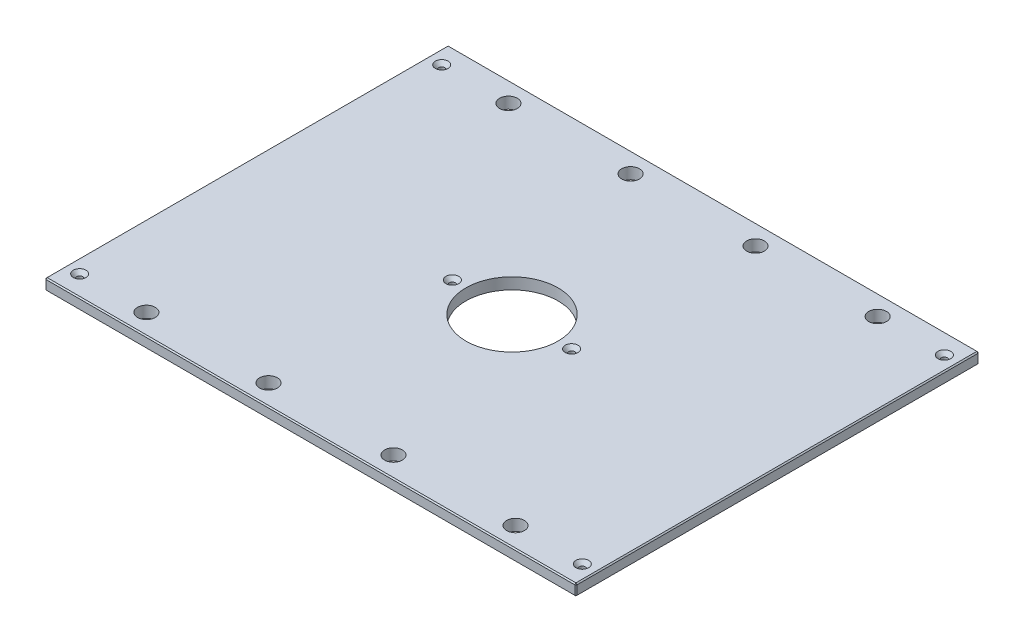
ISO-10303-21;
HEADER;
FILE_DESCRIPTION(('STEP AP214'),'2;1');
FILE_NAME('part.step','',(''),(''),'','','');
FILE_SCHEMA(('AUTOMOTIVE_DESIGN { 1 0 10303 214 1 1 1 1 }'));
ENDSEC;
DATA;
#1=APPLICATION_CONTEXT('core data for automotive mechanical design processes');
#2=APPLICATION_PROTOCOL_DEFINITION('international standard','automotive_design',2000,#1);
#3=PRODUCT_CONTEXT('',#1,'mechanical');
#4=PRODUCT('Part','Part','',(#3));
#5=PRODUCT_RELATED_PRODUCT_CATEGORY('part','',(#4));
#6=PRODUCT_DEFINITION_FORMATION('','',#4);
#7=PRODUCT_DEFINITION_CONTEXT('part definition',#1,'design');
#8=PRODUCT_DEFINITION('design','',#6,#7);
#9=PRODUCT_DEFINITION_SHAPE('','',#8);
#10=(LENGTH_UNIT() NAMED_UNIT(*) SI_UNIT(.MILLI.,.METRE.));
#11=(NAMED_UNIT(*) PLANE_ANGLE_UNIT() SI_UNIT($,.RADIAN.));
#12=(NAMED_UNIT(*) SI_UNIT($,.STERADIAN.) SOLID_ANGLE_UNIT());
#13=UNCERTAINTY_MEASURE_WITH_UNIT(LENGTH_MEASURE(1.E-05),#10,'distance_accuracy_value','');
#14=(GEOMETRIC_REPRESENTATION_CONTEXT(3) GLOBAL_UNCERTAINTY_ASSIGNED_CONTEXT((#13)) GLOBAL_UNIT_ASSIGNED_CONTEXT((#10,
#11,#12)) REPRESENTATION_CONTEXT('',''));
#15=CARTESIAN_POINT('',(0.,0.,0.));
#16=DIRECTION('',(0.,0.,1.));
#17=DIRECTION('',(1.,0.,0.));
#18=AXIS2_PLACEMENT_3D('',#15,#16,#17);
#19=CARTESIAN_POINT('',(-296.8625,12.7,-225.425));
#20=DIRECTION('',(1.,0.,0.));
#21=DIRECTION('',(0.,0.,-1.));
#22=AXIS2_PLACEMENT_3D('',#19,#20,#21);
#23=PLANE('',#22);
#24=DIRECTION('',(0.,0.,-1.));
#25=VECTOR('',#24,1.);
#26=CARTESIAN_POINT('',(-296.8625,11.43,-225.425));
#27=LINE('',#26,#25);
#28=CARTESIAN_POINT('',(-296.8625,11.43,224.155));
#29=VERTEX_POINT('',#28);
#30=CARTESIAN_POINT('',(-296.8625,11.43,-224.155));
#31=VERTEX_POINT('',#30);
#32=EDGE_CURVE('E135',#29,#31,#27,.T.);
#33=ORIENTED_EDGE('',*,*,#32,.T.);
#34=DIRECTION('',(0.,-1.,0.));
#35=VECTOR('',#34,1.);
#36=CARTESIAN_POINT('',(-296.8625,12.7,-224.155));
#37=LINE('',#36,#35);
#38=CARTESIAN_POINT('',(-296.8625,1.26999999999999,-224.155));
#39=VERTEX_POINT('',#38);
#40=EDGE_CURVE('E131',#31,#39,#37,.T.);
#41=ORIENTED_EDGE('',*,*,#40,.T.);
#42=DIRECTION('',(0.,0.,1.));
#43=VECTOR('',#42,1.);
#44=CARTESIAN_POINT('',(-296.8625,1.26999999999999,-225.425));
#45=LINE('',#44,#43);
#46=CARTESIAN_POINT('',(-296.8625,1.26999999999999,224.155));
#47=VERTEX_POINT('',#46);
#48=EDGE_CURVE('E126',#39,#47,#45,.T.);
#49=ORIENTED_EDGE('',*,*,#48,.T.);
#50=DIRECTION('',(0.,1.,0.));
#51=VECTOR('',#50,1.);
#52=CARTESIAN_POINT('',(-296.8625,12.7,224.155));
#53=LINE('',#52,#51);
#54=EDGE_CURVE('E128',#47,#29,#53,.T.);
#55=ORIENTED_EDGE('',*,*,#54,.T.);
#56=EDGE_LOOP('',(#33,#41,#49,#55));
#57=FACE_BOUND('',#56,.T.);
#58=ADVANCED_FACE('F35',(#57),#23,.F.);
#59=CARTESIAN_POINT('',(-296.8625,12.7,225.425));
#60=DIRECTION('',(0.,0.,-1.));
#61=DIRECTION('',(-1.,0.,0.));
#62=AXIS2_PLACEMENT_3D('',#59,#60,#61);
#63=PLANE('',#62);
#64=DIRECTION('',(1.,0.,0.));
#65=VECTOR('',#64,1.);
#66=CARTESIAN_POINT('',(-296.8625,1.2700000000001,225.425));
#67=LINE('',#66,#65);
#68=CARTESIAN_POINT('',(-295.5925,1.2700000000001,225.425));
#69=VERTEX_POINT('',#68);
#70=CARTESIAN_POINT('',(295.5925,1.2700000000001,225.425));
#71=VERTEX_POINT('',#70);
#72=EDGE_CURVE('E58',#69,#71,#67,.T.);
#73=ORIENTED_EDGE('',*,*,#72,.T.);
#74=DIRECTION('',(0.,1.,0.));
#75=VECTOR('',#74,1.);
#76=CARTESIAN_POINT('',(295.5925,12.7,225.425));
#77=LINE('',#76,#75);
#78=CARTESIAN_POINT('',(295.5925,11.4299999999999,225.425));
#79=VERTEX_POINT('',#78);
#80=EDGE_CURVE('E11',#71,#79,#77,.T.);
#81=ORIENTED_EDGE('',*,*,#80,.T.);
#82=DIRECTION('',(-1.,0.,0.));
#83=VECTOR('',#82,1.);
#84=CARTESIAN_POINT('',(-296.8625,11.4299999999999,225.425));
#85=LINE('',#84,#83);
#86=CARTESIAN_POINT('',(-295.5925,11.4299999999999,225.425));
#87=VERTEX_POINT('',#86);
#88=EDGE_CURVE('E44',#79,#87,#85,.T.);
#89=ORIENTED_EDGE('',*,*,#88,.T.);
#90=DIRECTION('',(0.,-1.,0.));
#91=VECTOR('',#90,1.);
#92=CARTESIAN_POINT('',(-295.5925,12.7,225.425));
#93=LINE('',#92,#91);
#94=EDGE_CURVE('E303',#87,#69,#93,.T.);
#95=ORIENTED_EDGE('',*,*,#94,.T.);
#96=EDGE_LOOP('',(#73,#81,#89,#95));
#97=FACE_BOUND('',#96,.T.);
#98=ADVANCED_FACE('F372',(#97),#63,.F.);
#99=CARTESIAN_POINT('',(296.8625,12.7,-225.425));
#100=DIRECTION('',(-1.,0.,0.));
#101=DIRECTION('',(0.,0.,1.));
#102=AXIS2_PLACEMENT_3D('',#99,#100,#101);
#103=PLANE('',#102);
#104=DIRECTION('',(0.,0.,-1.));
#105=VECTOR('',#104,1.);
#106=CARTESIAN_POINT('',(296.8625,1.2700000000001,-225.425));
#107=LINE('',#106,#105);
#108=CARTESIAN_POINT('',(296.8625,1.2700000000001,224.155));
#109=VERTEX_POINT('',#108);
#110=CARTESIAN_POINT('',(296.8625,1.2700000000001,-224.155));
#111=VERTEX_POINT('',#110);
#112=EDGE_CURVE('E298',#109,#111,#107,.T.);
#113=ORIENTED_EDGE('',*,*,#112,.T.);
#114=DIRECTION('',(0.,1.,0.));
#115=VECTOR('',#114,1.);
#116=CARTESIAN_POINT('',(296.8625,12.7,-224.155));
#117=LINE('',#116,#115);
#118=CARTESIAN_POINT('',(296.8625,11.43,-224.155));
#119=VERTEX_POINT('',#118);
#120=EDGE_CURVE('E300',#111,#119,#117,.T.);
#121=ORIENTED_EDGE('',*,*,#120,.T.);
#122=DIRECTION('',(0.,0.,1.));
#123=VECTOR('',#122,1.);
#124=CARTESIAN_POINT('',(296.8625,11.43,225.425));
#125=LINE('',#124,#123);
#126=CARTESIAN_POINT('',(296.8625,11.43,224.155));
#127=VERTEX_POINT('',#126);
#128=EDGE_CURVE('E296',#119,#127,#125,.T.);
#129=ORIENTED_EDGE('',*,*,#128,.T.);
#130=DIRECTION('',(0.,-1.,0.));
#131=VECTOR('',#130,1.);
#132=CARTESIAN_POINT('',(296.8625,12.7,224.155));
#133=LINE('',#132,#131);
#134=EDGE_CURVE('E294',#127,#109,#133,.T.);
#135=ORIENTED_EDGE('',*,*,#134,.T.);
#136=EDGE_LOOP('',(#113,#121,#129,#135));
#137=FACE_BOUND('',#136,.T.);
#138=ADVANCED_FACE('F359',(#137),#103,.F.);
#139=CARTESIAN_POINT('',(-296.8625,12.7,-225.425));
#140=DIRECTION('',(0.,0.,1.));
#141=DIRECTION('',(1.,0.,0.));
#142=AXIS2_PLACEMENT_3D('',#139,#140,#141);
#143=PLANE('',#142);
#144=DIRECTION('',(-1.,0.,0.));
#145=VECTOR('',#144,1.);
#146=CARTESIAN_POINT('',(-296.8625,1.2700000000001,-225.425));
#147=LINE('',#146,#145);
#148=CARTESIAN_POINT('',(295.5925,1.2700000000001,-225.425));
#149=VERTEX_POINT('',#148);
#150=CARTESIAN_POINT('',(-295.5925,1.2700000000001,-225.425));
#151=VERTEX_POINT('',#150);
#152=EDGE_CURVE('E270',#149,#151,#147,.T.);
#153=ORIENTED_EDGE('',*,*,#152,.T.);
#154=DIRECTION('',(0.,1.,0.));
#155=VECTOR('',#154,1.);
#156=CARTESIAN_POINT('',(-295.5925,12.7,-225.425));
#157=LINE('',#156,#155);
#158=CARTESIAN_POINT('',(-295.5925,11.43,-225.425));
#159=VERTEX_POINT('',#158);
#160=EDGE_CURVE('E274',#151,#159,#157,.T.);
#161=ORIENTED_EDGE('',*,*,#160,.T.);
#162=DIRECTION('',(1.,0.,0.));
#163=VECTOR('',#162,1.);
#164=CARTESIAN_POINT('',(296.8625,11.43,-225.425));
#165=LINE('',#164,#163);
#166=CARTESIAN_POINT('',(295.5925,11.43,-225.425));
#167=VERTEX_POINT('',#166);
#168=EDGE_CURVE('E272',#159,#167,#165,.T.);
#169=ORIENTED_EDGE('',*,*,#168,.T.);
#170=DIRECTION('',(0.,-1.,0.));
#171=VECTOR('',#170,1.);
#172=CARTESIAN_POINT('',(295.5925,12.7,-225.425));
#173=LINE('',#172,#171);
#174=EDGE_CURVE('E268',#167,#149,#173,.T.);
#175=ORIENTED_EDGE('',*,*,#174,.T.);
#176=EDGE_LOOP('',(#153,#161,#169,#175));
#177=FACE_BOUND('',#176,.T.);
#178=ADVANCED_FACE('F333',(#177),#143,.F.);
#179=CARTESIAN_POINT('',(0.,12.7,0.));
#180=DIRECTION('',(0.,1.,0.));
#181=DIRECTION('',(0.,0.,1.));
#182=AXIS2_PLACEMENT_3D('',#179,#180,#181);
#183=PLANE('',#182);
#184=CARTESIAN_POINT('',(280.9875,12.7,-202.40498));
#185=DIRECTION('',(0.,1.,0.));
#186=DIRECTION('',(0.,0.,1.));
#187=AXIS2_PLACEMENT_3D('',#184,#185,#186);
#188=CIRCLE('',#187,7.13740000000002);
#189=CARTESIAN_POINT('',(280.9875,12.7,-195.26758));
#190=VERTEX_POINT('',#189);
#191=EDGE_CURVE('E816',#190,#190,#188,.T.);
#192=ORIENTED_EDGE('',*,*,#191,.F.);
#193=EDGE_LOOP('',(#192));
#194=FACE_BOUND('',#193,.T.);
#195=CARTESIAN_POINT('',(280.9875,12.7,202.40498));
#196=DIRECTION('',(0.,1.,0.));
#197=DIRECTION('',(0.,0.,1.));
#198=AXIS2_PLACEMENT_3D('',#195,#196,#197);
#199=CIRCLE('',#198,7.13740000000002);
#200=CARTESIAN_POINT('',(280.9875,12.7,209.54238));
#201=VERTEX_POINT('',#200);
#202=EDGE_CURVE('E820',#201,#201,#199,.T.);
#203=ORIENTED_EDGE('',*,*,#202,.F.);
#204=EDGE_LOOP('',(#203));
#205=FACE_BOUND('',#204,.T.);
#206=CARTESIAN_POINT('',(-280.9875,12.7,202.40498));
#207=DIRECTION('',(0.,1.,0.));
#208=DIRECTION('',(0.,0.,1.));
#209=AXIS2_PLACEMENT_3D('',#206,#207,#208);
#210=CIRCLE('',#209,7.13740000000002);
#211=CARTESIAN_POINT('',(-280.9875,12.7,209.54238));
#212=VERTEX_POINT('',#211);
#213=EDGE_CURVE('E824',#212,#212,#210,.T.);
#214=ORIENTED_EDGE('',*,*,#213,.F.);
#215=EDGE_LOOP('',(#214));
#216=FACE_BOUND('',#215,.T.);
#217=CARTESIAN_POINT('',(-66.675,12.7,0.));
#218=DIRECTION('',(0.,1.,0.));
#219=DIRECTION('',(0.,0.,1.));
#220=AXIS2_PLACEMENT_3D('',#217,#218,#219);
#221=CIRCLE('',#220,7.1374);
#222=CARTESIAN_POINT('',(-66.675,12.7,7.1374));
#223=VERTEX_POINT('',#222);
#224=EDGE_CURVE('E828',#223,#223,#221,.T.);
#225=ORIENTED_EDGE('',*,*,#224,.F.);
#226=EDGE_LOOP('',(#225));
#227=FACE_BOUND('',#226,.T.);
#228=CARTESIAN_POINT('',(66.675,12.7,0.));
#229=DIRECTION('',(0.,1.,0.));
#230=DIRECTION('',(0.,0.,1.));
#231=AXIS2_PLACEMENT_3D('',#228,#229,#230);
#232=CIRCLE('',#231,7.1374);
#233=CARTESIAN_POINT('',(66.675,12.7,7.1374));
#234=VERTEX_POINT('',#233);
#235=EDGE_CURVE('E832',#234,#234,#232,.T.);
#236=ORIENTED_EDGE('',*,*,#235,.F.);
#237=EDGE_LOOP('',(#236));
#238=FACE_BOUND('',#237,.T.);
#239=CARTESIAN_POINT('',(-280.9875,12.7,-202.40498));
#240=DIRECTION('',(0.,1.,0.));
#241=DIRECTION('',(0.,0.,1.));
#242=AXIS2_PLACEMENT_3D('',#239,#240,#241);
#243=CIRCLE('',#242,7.13740000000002);
#244=CARTESIAN_POINT('',(-280.9875,12.7,-195.26758));
#245=VERTEX_POINT('',#244);
#246=EDGE_CURVE('E835',#245,#245,#243,.T.);
#247=ORIENTED_EDGE('',*,*,#246,.F.);
#248=EDGE_LOOP('',(#247));
#249=FACE_BOUND('',#248,.T.);
#250=DIRECTION('',(0.,0.,-1.));
#251=VECTOR('',#250,1.);
#252=CARTESIAN_POINT('',(295.5925,12.7,-225.425));
#253=LINE('',#252,#251);
#254=CARTESIAN_POINT('',(295.5925,12.7,224.155));
#255=VERTEX_POINT('',#254);
#256=CARTESIAN_POINT('',(295.5925,12.7,-224.155));
#257=VERTEX_POINT('',#256);
#258=EDGE_CURVE('E281',#255,#257,#253,.T.);
#259=ORIENTED_EDGE('',*,*,#258,.T.);
#260=DIRECTION('',(-1.,0.,0.));
#261=VECTOR('',#260,1.);
#262=CARTESIAN_POINT('',(-296.8625,12.7,-224.155));
#263=LINE('',#262,#261);
#264=CARTESIAN_POINT('',(-295.5925,12.7,-224.155));
#265=VERTEX_POINT('',#264);
#266=EDGE_CURVE('E283',#257,#265,#263,.T.);
#267=ORIENTED_EDGE('',*,*,#266,.T.);
#268=DIRECTION('',(0.,0.,1.));
#269=VECTOR('',#268,1.);
#270=CARTESIAN_POINT('',(-295.5925,12.7,225.425));
#271=LINE('',#270,#269);
#272=CARTESIAN_POINT('',(-295.5925,12.7,224.155));
#273=VERTEX_POINT('',#272);
#274=EDGE_CURVE('E279',#265,#273,#271,.T.);
#275=ORIENTED_EDGE('',*,*,#274,.T.);
#276=DIRECTION('',(1.,0.,0.));
#277=VECTOR('',#276,1.);
#278=CARTESIAN_POINT('',(296.8625,12.7,224.155));
#279=LINE('',#278,#277);
#280=EDGE_CURVE('E277',#273,#255,#279,.T.);
#281=ORIENTED_EDGE('',*,*,#280,.T.);
#282=EDGE_LOOP('',(#259,#267,#275,#281));
#283=FACE_BOUND('',#282,.T.);
#284=CARTESIAN_POINT('',(206.375,12.7,-202.40498));
#285=DIRECTION('',(0.,1.,0.));
#286=DIRECTION('',(0.,0.,1.));
#287=AXIS2_PLACEMENT_3D('',#284,#285,#286);
#288=CIRCLE('',#287,9.921875);
#289=CARTESIAN_POINT('',(206.375,12.7,-192.483105));
#290=VERTEX_POINT('',#289);
#291=EDGE_CURVE('E204',#290,#290,#288,.T.);
#292=ORIENTED_EDGE('',*,*,#291,.F.);
#293=EDGE_LOOP('',(#292));
#294=FACE_BOUND('',#293,.T.);
#295=CARTESIAN_POINT('',(-206.375,12.7,-202.40498));
#296=DIRECTION('',(0.,1.,0.));
#297=DIRECTION('',(0.,0.,1.));
#298=AXIS2_PLACEMENT_3D('',#295,#296,#297);
#299=CIRCLE('',#298,9.921875);
#300=CARTESIAN_POINT('',(-206.375,12.7,-192.483105));
#301=VERTEX_POINT('',#300);
#302=EDGE_CURVE('E214',#301,#301,#299,.T.);
#303=ORIENTED_EDGE('',*,*,#302,.F.);
#304=EDGE_LOOP('',(#303));
#305=FACE_BOUND('',#304,.T.);
#306=CARTESIAN_POINT('',(206.375,12.7,202.40498));
#307=DIRECTION('',(0.,1.,0.));
#308=DIRECTION('',(0.,0.,1.));
#309=AXIS2_PLACEMENT_3D('',#306,#307,#308);
#310=CIRCLE('',#309,9.921875);
#311=CARTESIAN_POINT('',(206.375,12.7,212.326855));
#312=VERTEX_POINT('',#311);
#313=EDGE_CURVE('E225',#312,#312,#310,.T.);
#314=ORIENTED_EDGE('',*,*,#313,.F.);
#315=EDGE_LOOP('',(#314));
#316=FACE_BOUND('',#315,.T.);
#317=CARTESIAN_POINT('',(-206.375,12.7,202.40498));
#318=DIRECTION('',(0.,1.,0.));
#319=DIRECTION('',(0.,0.,1.));
#320=AXIS2_PLACEMENT_3D('',#317,#318,#319);
#321=CIRCLE('',#320,9.921875);
#322=CARTESIAN_POINT('',(-206.375,12.7,212.326855));
#323=VERTEX_POINT('',#322);
#324=EDGE_CURVE('E231',#323,#323,#321,.T.);
#325=ORIENTED_EDGE('',*,*,#324,.F.);
#326=EDGE_LOOP('',(#325));
#327=FACE_BOUND('',#326,.T.);
#328=CARTESIAN_POINT('',(-69.85,12.7,-202.40498));
#329=DIRECTION('',(0.,1.,0.));
#330=DIRECTION('',(0.,0.,1.));
#331=AXIS2_PLACEMENT_3D('',#328,#329,#330);
#332=CIRCLE('',#331,9.921875);
#333=CARTESIAN_POINT('',(-69.85,12.7,-192.483105));
#334=VERTEX_POINT('',#333);
#335=EDGE_CURVE('E237',#334,#334,#332,.T.);
#336=ORIENTED_EDGE('',*,*,#335,.F.);
#337=EDGE_LOOP('',(#336));
#338=FACE_BOUND('',#337,.T.);
#339=CARTESIAN_POINT('',(69.85,12.7,-202.40498));
#340=DIRECTION('',(0.,1.,0.));
#341=DIRECTION('',(0.,0.,1.));
#342=AXIS2_PLACEMENT_3D('',#339,#340,#341);
#343=CIRCLE('',#342,9.921875);
#344=CARTESIAN_POINT('',(69.85,12.7,-192.483105));
#345=VERTEX_POINT('',#344);
#346=EDGE_CURVE('E243',#345,#345,#343,.T.);
#347=ORIENTED_EDGE('',*,*,#346,.F.);
#348=EDGE_LOOP('',(#347));
#349=FACE_BOUND('',#348,.T.);
#350=CARTESIAN_POINT('',(69.85,12.7,202.40498));
#351=DIRECTION('',(0.,1.,0.));
#352=DIRECTION('',(0.,0.,1.));
#353=AXIS2_PLACEMENT_3D('',#350,#351,#352);
#354=CIRCLE('',#353,9.921875);
#355=CARTESIAN_POINT('',(69.85,12.7,212.326855));
#356=VERTEX_POINT('',#355);
#357=EDGE_CURVE('E249',#356,#356,#354,.T.);
#358=ORIENTED_EDGE('',*,*,#357,.F.);
#359=EDGE_LOOP('',(#358));
#360=FACE_BOUND('',#359,.T.);
#361=CARTESIAN_POINT('',(-69.85,12.7,202.40498));
#362=DIRECTION('',(0.,1.,0.));
#363=DIRECTION('',(0.,0.,1.));
#364=AXIS2_PLACEMENT_3D('',#361,#362,#363);
#365=CIRCLE('',#364,9.921875);
#366=CARTESIAN_POINT('',(-69.85,12.7,212.326855));
#367=VERTEX_POINT('',#366);
#368=EDGE_CURVE('E255',#367,#367,#365,.T.);
#369=ORIENTED_EDGE('',*,*,#368,.F.);
#370=EDGE_LOOP('',(#369));
#371=FACE_BOUND('',#370,.T.);
#372=CARTESIAN_POINT('',(0.,12.7,0.));
#373=DIRECTION('',(0.,1.,0.));
#374=DIRECTION('',(0.,0.,1.));
#375=AXIS2_PLACEMENT_3D('',#372,#373,#374);
#376=CIRCLE('',#375,51.562);
#377=CARTESIAN_POINT('',(0.,12.7,51.562));
#378=VERTEX_POINT('',#377);
#379=EDGE_CURVE('E261',#378,#378,#376,.T.);
#380=ORIENTED_EDGE('',*,*,#379,.F.);
#381=EDGE_LOOP('',(#380));
#382=FACE_BOUND('',#381,.T.);
#383=ADVANCED_FACE('F381',(#194,#205,#216,#227,#238,#249,#283,#294,#305,#316,#327,#338,#349,
#360,#371,#382),#183,.T.);
#384=CARTESIAN_POINT('',(0.,0.,0.));
#385=DIRECTION('',(0.,1.,0.));
#386=DIRECTION('',(0.,0.,1.));
#387=AXIS2_PLACEMENT_3D('',#384,#385,#386);
#388=PLANE('',#387);
#389=CARTESIAN_POINT('',(280.9875,0.,-202.40498));
#390=DIRECTION('',(0.,1.,0.));
#391=DIRECTION('',(0.,0.,1.));
#392=AXIS2_PLACEMENT_3D('',#389,#390,#391);
#393=CIRCLE('',#392,3.3782);
#394=CARTESIAN_POINT('',(280.9875,0.,-199.02678));
#395=VERTEX_POINT('',#394);
#396=EDGE_CURVE('E869',#395,#395,#393,.T.);
#397=ORIENTED_EDGE('',*,*,#396,.T.);
#398=EDGE_LOOP('',(#397));
#399=FACE_BOUND('',#398,.T.);
#400=CARTESIAN_POINT('',(280.9875,0.,202.40498));
#401=DIRECTION('',(0.,1.,0.));
#402=DIRECTION('',(0.,0.,1.));
#403=AXIS2_PLACEMENT_3D('',#400,#401,#402);
#404=CIRCLE('',#403,3.3782);
#405=CARTESIAN_POINT('',(280.9875,0.,205.78318));
#406=VERTEX_POINT('',#405);
#407=EDGE_CURVE('E862',#406,#406,#404,.T.);
#408=ORIENTED_EDGE('',*,*,#407,.T.);
#409=EDGE_LOOP('',(#408));
#410=FACE_BOUND('',#409,.T.);
#411=CARTESIAN_POINT('',(-280.9875,0.,202.40498));
#412=DIRECTION('',(0.,1.,0.));
#413=DIRECTION('',(0.,0.,1.));
#414=AXIS2_PLACEMENT_3D('',#411,#412,#413);
#415=CIRCLE('',#414,3.3782);
#416=CARTESIAN_POINT('',(-280.9875,0.,205.78318));
#417=VERTEX_POINT('',#416);
#418=EDGE_CURVE('E855',#417,#417,#415,.T.);
#419=ORIENTED_EDGE('',*,*,#418,.T.);
#420=EDGE_LOOP('',(#419));
#421=FACE_BOUND('',#420,.T.);
#422=CARTESIAN_POINT('',(-66.675,0.,0.));
#423=DIRECTION('',(0.,1.,0.));
#424=DIRECTION('',(0.,0.,1.));
#425=AXIS2_PLACEMENT_3D('',#422,#423,#424);
#426=CIRCLE('',#425,3.3782);
#427=CARTESIAN_POINT('',(-66.675,0.,3.3782));
#428=VERTEX_POINT('',#427);
#429=EDGE_CURVE('E848',#428,#428,#426,.T.);
#430=ORIENTED_EDGE('',*,*,#429,.T.);
#431=EDGE_LOOP('',(#430));
#432=FACE_BOUND('',#431,.T.);
#433=CARTESIAN_POINT('',(66.675,0.,0.));
#434=DIRECTION('',(0.,1.,0.));
#435=DIRECTION('',(0.,0.,1.));
#436=AXIS2_PLACEMENT_3D('',#433,#434,#435);
#437=CIRCLE('',#436,3.3782);
#438=CARTESIAN_POINT('',(66.675,0.,3.3782));
#439=VERTEX_POINT('',#438);
#440=EDGE_CURVE('E838',#439,#439,#437,.T.);
#441=ORIENTED_EDGE('',*,*,#440,.T.);
#442=EDGE_LOOP('',(#441));
#443=FACE_BOUND('',#442,.T.);
#444=CARTESIAN_POINT('',(-280.9875,0.,-202.40498));
#445=DIRECTION('',(0.,1.,0.));
#446=DIRECTION('',(0.,0.,1.));
#447=AXIS2_PLACEMENT_3D('',#444,#445,#446);
#448=CIRCLE('',#447,3.3782);
#449=CARTESIAN_POINT('',(-280.9875,0.,-199.02678));
#450=VERTEX_POINT('',#449);
#451=EDGE_CURVE('E217',#450,#450,#448,.T.);
#452=ORIENTED_EDGE('',*,*,#451,.T.);
#453=EDGE_LOOP('',(#452));
#454=FACE_BOUND('',#453,.T.);
#455=DIRECTION('',(0.,0.,-1.));
#456=VECTOR('',#455,1.);
#457=CARTESIAN_POINT('',(-295.5925,0.,0.));
#458=LINE('',#457,#456);
#459=CARTESIAN_POINT('',(-295.5925,0.,224.155));
#460=VERTEX_POINT('',#459);
#461=CARTESIAN_POINT('',(-295.5925,0.,-224.155));
#462=VERTEX_POINT('',#461);
#463=EDGE_CURVE('E158',#460,#462,#458,.T.);
#464=ORIENTED_EDGE('',*,*,#463,.T.);
#465=DIRECTION('',(1.,0.,0.));
#466=VECTOR('',#465,1.);
#467=CARTESIAN_POINT('',(0.,0.,-224.155));
#468=LINE('',#467,#466);
#469=CARTESIAN_POINT('',(295.5925,0.,-224.155));
#470=VERTEX_POINT('',#469);
#471=EDGE_CURVE('E291',#462,#470,#468,.T.);
#472=ORIENTED_EDGE('',*,*,#471,.T.);
#473=DIRECTION('',(0.,0.,1.));
#474=VECTOR('',#473,1.);
#475=CARTESIAN_POINT('',(295.5925,0.,0.));
#476=LINE('',#475,#474);
#477=CARTESIAN_POINT('',(295.5925,0.,224.155));
#478=VERTEX_POINT('',#477);
#479=EDGE_CURVE('E289',#470,#478,#476,.T.);
#480=ORIENTED_EDGE('',*,*,#479,.T.);
#481=DIRECTION('',(-1.,0.,0.));
#482=VECTOR('',#481,1.);
#483=CARTESIAN_POINT('',(0.,0.,224.155));
#484=LINE('',#483,#482);
#485=EDGE_CURVE('E286',#478,#460,#484,.T.);
#486=ORIENTED_EDGE('',*,*,#485,.T.);
#487=EDGE_LOOP('',(#464,#472,#480,#486));
#488=FACE_BOUND('',#487,.T.);
#489=CARTESIAN_POINT('',(206.375,0.,-202.40498));
#490=DIRECTION('',(0.,1.,0.));
#491=DIRECTION('',(0.,0.,1.));
#492=AXIS2_PLACEMENT_3D('',#489,#490,#491);
#493=CIRCLE('',#492,9.921875);
#494=CARTESIAN_POINT('',(206.375,0.,-192.483105));
#495=VERTEX_POINT('',#494);
#496=EDGE_CURVE('E209',#495,#495,#493,.T.);
#497=ORIENTED_EDGE('',*,*,#496,.T.);
#498=EDGE_LOOP('',(#497));
#499=FACE_BOUND('',#498,.T.);
#500=CARTESIAN_POINT('',(-206.375,0.,-202.40498));
#501=DIRECTION('',(0.,1.,0.));
#502=DIRECTION('',(0.,0.,1.));
#503=AXIS2_PLACEMENT_3D('',#500,#501,#502);
#504=CIRCLE('',#503,9.921875);
#505=CARTESIAN_POINT('',(-206.375,0.,-192.483105));
#506=VERTEX_POINT('',#505);
#507=EDGE_CURVE('E222',#506,#506,#504,.T.);
#508=ORIENTED_EDGE('',*,*,#507,.T.);
#509=EDGE_LOOP('',(#508));
#510=FACE_BOUND('',#509,.T.);
#511=CARTESIAN_POINT('',(206.375,0.,202.40498));
#512=DIRECTION('',(0.,1.,0.));
#513=DIRECTION('',(0.,0.,1.));
#514=AXIS2_PLACEMENT_3D('',#511,#512,#513);
#515=CIRCLE('',#514,9.921875);
#516=CARTESIAN_POINT('',(206.375,0.,212.326855));
#517=VERTEX_POINT('',#516);
#518=EDGE_CURVE('E228',#517,#517,#515,.T.);
#519=ORIENTED_EDGE('',*,*,#518,.T.);
#520=EDGE_LOOP('',(#519));
#521=FACE_BOUND('',#520,.T.);
#522=CARTESIAN_POINT('',(-206.375,0.,202.40498));
#523=DIRECTION('',(0.,1.,0.));
#524=DIRECTION('',(0.,0.,1.));
#525=AXIS2_PLACEMENT_3D('',#522,#523,#524);
#526=CIRCLE('',#525,9.921875);
#527=CARTESIAN_POINT('',(-206.375,0.,212.326855));
#528=VERTEX_POINT('',#527);
#529=EDGE_CURVE('E234',#528,#528,#526,.T.);
#530=ORIENTED_EDGE('',*,*,#529,.T.);
#531=EDGE_LOOP('',(#530));
#532=FACE_BOUND('',#531,.T.);
#533=CARTESIAN_POINT('',(-69.85,0.,-202.40498));
#534=DIRECTION('',(0.,1.,0.));
#535=DIRECTION('',(0.,0.,1.));
#536=AXIS2_PLACEMENT_3D('',#533,#534,#535);
#537=CIRCLE('',#536,9.921875);
#538=CARTESIAN_POINT('',(-69.85,0.,-192.483105));
#539=VERTEX_POINT('',#538);
#540=EDGE_CURVE('E240',#539,#539,#537,.T.);
#541=ORIENTED_EDGE('',*,*,#540,.T.);
#542=EDGE_LOOP('',(#541));
#543=FACE_BOUND('',#542,.T.);
#544=CARTESIAN_POINT('',(69.85,0.,-202.40498));
#545=DIRECTION('',(0.,1.,0.));
#546=DIRECTION('',(0.,0.,1.));
#547=AXIS2_PLACEMENT_3D('',#544,#545,#546);
#548=CIRCLE('',#547,9.921875);
#549=CARTESIAN_POINT('',(69.85,0.,-192.483105));
#550=VERTEX_POINT('',#549);
#551=EDGE_CURVE('E246',#550,#550,#548,.T.);
#552=ORIENTED_EDGE('',*,*,#551,.T.);
#553=EDGE_LOOP('',(#552));
#554=FACE_BOUND('',#553,.T.);
#555=CARTESIAN_POINT('',(69.85,0.,202.40498));
#556=DIRECTION('',(0.,1.,0.));
#557=DIRECTION('',(0.,0.,1.));
#558=AXIS2_PLACEMENT_3D('',#555,#556,#557);
#559=CIRCLE('',#558,9.921875);
#560=CARTESIAN_POINT('',(69.85,0.,212.326855));
#561=VERTEX_POINT('',#560);
#562=EDGE_CURVE('E252',#561,#561,#559,.T.);
#563=ORIENTED_EDGE('',*,*,#562,.T.);
#564=EDGE_LOOP('',(#563));
#565=FACE_BOUND('',#564,.T.);
#566=CARTESIAN_POINT('',(-69.85,0.,202.40498));
#567=DIRECTION('',(0.,1.,0.));
#568=DIRECTION('',(0.,0.,1.));
#569=AXIS2_PLACEMENT_3D('',#566,#567,#568);
#570=CIRCLE('',#569,9.921875);
#571=CARTESIAN_POINT('',(-69.85,0.,212.326855));
#572=VERTEX_POINT('',#571);
#573=EDGE_CURVE('E258',#572,#572,#570,.T.);
#574=ORIENTED_EDGE('',*,*,#573,.T.);
#575=EDGE_LOOP('',(#574));
#576=FACE_BOUND('',#575,.T.);
#577=CARTESIAN_POINT('',(0.,0.,0.));
#578=DIRECTION('',(0.,1.,0.));
#579=DIRECTION('',(0.,0.,1.));
#580=AXIS2_PLACEMENT_3D('',#577,#578,#579);
#581=CIRCLE('',#580,51.562);
#582=CARTESIAN_POINT('',(0.,0.,51.562));
#583=VERTEX_POINT('',#582);
#584=EDGE_CURVE('E147',#583,#583,#581,.T.);
#585=ORIENTED_EDGE('',*,*,#584,.T.);
#586=EDGE_LOOP('',(#585));
#587=FACE_BOUND('',#586,.T.);
#588=ADVANCED_FACE('F346',(#399,#410,#421,#432,#443,#454,#488,#499,#510,#521,#532,#543,#554,
#565,#576,#587),#388,.F.);
#589=CARTESIAN_POINT('',(0.,0.,0.));
#590=DIRECTION('',(0.,1.,0.));
#591=DIRECTION('',(0.,0.,1.));
#592=AXIS2_PLACEMENT_3D('',#589,#590,#591);
#593=CYLINDRICAL_SURFACE('',#592,51.562);
#594=ORIENTED_EDGE('',*,*,#584,.F.);
#595=EDGE_LOOP('',(#594));
#596=FACE_BOUND('',#595,.T.);
#597=ORIENTED_EDGE('',*,*,#379,.T.);
#598=EDGE_LOOP('',(#597));
#599=FACE_BOUND('',#598,.T.);
#600=ADVANCED_FACE('F751',(#596,#599),#593,.F.);
#601=CARTESIAN_POINT('',(-69.85,12.7,202.40498));
#602=DIRECTION('',(0.,1.,0.));
#603=DIRECTION('',(0.,0.,1.));
#604=AXIS2_PLACEMENT_3D('',#601,#602,#603);
#605=CYLINDRICAL_SURFACE('',#604,9.921875);
#606=ORIENTED_EDGE('',*,*,#573,.F.);
#607=EDGE_LOOP('',(#606));
#608=FACE_BOUND('',#607,.T.);
#609=ORIENTED_EDGE('',*,*,#368,.T.);
#610=EDGE_LOOP('',(#609));
#611=FACE_BOUND('',#610,.T.);
#612=ADVANCED_FACE('F742',(#608,#611),#605,.F.);
#613=CARTESIAN_POINT('',(69.85,12.7,202.40498));
#614=DIRECTION('',(0.,1.,0.));
#615=DIRECTION('',(0.,0.,1.));
#616=AXIS2_PLACEMENT_3D('',#613,#614,#615);
#617=CYLINDRICAL_SURFACE('',#616,9.921875);
#618=ORIENTED_EDGE('',*,*,#562,.F.);
#619=EDGE_LOOP('',(#618));
#620=FACE_BOUND('',#619,.T.);
#621=ORIENTED_EDGE('',*,*,#357,.T.);
#622=EDGE_LOOP('',(#621));
#623=FACE_BOUND('',#622,.T.);
#624=ADVANCED_FACE('F733',(#620,#623),#617,.F.);
#625=CARTESIAN_POINT('',(69.85,12.7,-202.40498));
#626=DIRECTION('',(0.,1.,0.));
#627=DIRECTION('',(0.,0.,1.));
#628=AXIS2_PLACEMENT_3D('',#625,#626,#627);
#629=CYLINDRICAL_SURFACE('',#628,9.921875);
#630=ORIENTED_EDGE('',*,*,#551,.F.);
#631=EDGE_LOOP('',(#630));
#632=FACE_BOUND('',#631,.T.);
#633=ORIENTED_EDGE('',*,*,#346,.T.);
#634=EDGE_LOOP('',(#633));
#635=FACE_BOUND('',#634,.T.);
#636=ADVANCED_FACE('F724',(#632,#635),#629,.F.);
#637=CARTESIAN_POINT('',(-69.85,12.7,-202.40498));
#638=DIRECTION('',(0.,1.,0.));
#639=DIRECTION('',(0.,0.,1.));
#640=AXIS2_PLACEMENT_3D('',#637,#638,#639);
#641=CYLINDRICAL_SURFACE('',#640,9.921875);
#642=ORIENTED_EDGE('',*,*,#540,.F.);
#643=EDGE_LOOP('',(#642));
#644=FACE_BOUND('',#643,.T.);
#645=ORIENTED_EDGE('',*,*,#335,.T.);
#646=EDGE_LOOP('',(#645));
#647=FACE_BOUND('',#646,.T.);
#648=ADVANCED_FACE('F715',(#644,#647),#641,.F.);
#649=CARTESIAN_POINT('',(-206.375,12.7,202.40498));
#650=DIRECTION('',(0.,1.,0.));
#651=DIRECTION('',(0.,0.,1.));
#652=AXIS2_PLACEMENT_3D('',#649,#650,#651);
#653=CYLINDRICAL_SURFACE('',#652,9.921875);
#654=ORIENTED_EDGE('',*,*,#529,.F.);
#655=EDGE_LOOP('',(#654));
#656=FACE_BOUND('',#655,.T.);
#657=ORIENTED_EDGE('',*,*,#324,.T.);
#658=EDGE_LOOP('',(#657));
#659=FACE_BOUND('',#658,.T.);
#660=ADVANCED_FACE('F706',(#656,#659),#653,.F.);
#661=CARTESIAN_POINT('',(206.375,12.7,202.40498));
#662=DIRECTION('',(0.,1.,0.));
#663=DIRECTION('',(0.,0.,1.));
#664=AXIS2_PLACEMENT_3D('',#661,#662,#663);
#665=CYLINDRICAL_SURFACE('',#664,9.921875);
#666=ORIENTED_EDGE('',*,*,#518,.F.);
#667=EDGE_LOOP('',(#666));
#668=FACE_BOUND('',#667,.T.);
#669=ORIENTED_EDGE('',*,*,#313,.T.);
#670=EDGE_LOOP('',(#669));
#671=FACE_BOUND('',#670,.T.);
#672=ADVANCED_FACE('F697',(#668,#671),#665,.F.);
#673=CARTESIAN_POINT('',(-206.375,12.7,-202.40498));
#674=DIRECTION('',(0.,1.,0.));
#675=DIRECTION('',(0.,0.,1.));
#676=AXIS2_PLACEMENT_3D('',#673,#674,#675);
#677=CYLINDRICAL_SURFACE('',#676,9.921875);
#678=ORIENTED_EDGE('',*,*,#507,.F.);
#679=EDGE_LOOP('',(#678));
#680=FACE_BOUND('',#679,.T.);
#681=ORIENTED_EDGE('',*,*,#302,.T.);
#682=EDGE_LOOP('',(#681));
#683=FACE_BOUND('',#682,.T.);
#684=ADVANCED_FACE('F687',(#680,#683),#677,.F.);
#685=CARTESIAN_POINT('',(206.375,12.7,-202.40498));
#686=DIRECTION('',(0.,1.,0.));
#687=DIRECTION('',(0.,0.,1.));
#688=AXIS2_PLACEMENT_3D('',#685,#686,#687);
#689=CYLINDRICAL_SURFACE('',#688,9.921875);
#690=ORIENTED_EDGE('',*,*,#496,.F.);
#691=EDGE_LOOP('',(#690));
#692=FACE_BOUND('',#691,.T.);
#693=ORIENTED_EDGE('',*,*,#291,.T.);
#694=EDGE_LOOP('',(#693));
#695=FACE_BOUND('',#694,.T.);
#696=ADVANCED_FACE('F390',(#692,#695),#689,.F.);
#697=CARTESIAN_POINT('',(296.8625,12.7,224.155));
#698=DIRECTION('',(-0.707106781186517,0.,-0.707106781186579));
#699=DIRECTION('',(0.,-1.,0.));
#700=AXIS2_PLACEMENT_3D('',#697,#698,#699);
#701=PLANE('',#700);
#702=DIRECTION('',(-0.707106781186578,0.,0.707106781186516));
#703=VECTOR('',#702,1.);
#704=CARTESIAN_POINT('',(296.8625,11.43,224.155));
#705=LINE('',#704,#703);
#706=EDGE_CURVE('E39',#79,#127,#705,.F.);
#707=ORIENTED_EDGE('',*,*,#706,.F.);
#708=ORIENTED_EDGE('',*,*,#80,.F.);
#709=DIRECTION('',(0.707106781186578,0.,-0.707106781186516));
#710=VECTOR('',#709,1.);
#711=CARTESIAN_POINT('',(296.2275,1.2700000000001,224.79));
#712=LINE('',#711,#710);
#713=EDGE_CURVE('E197',#109,#71,#712,.F.);
#714=ORIENTED_EDGE('',*,*,#713,.F.);
#715=ORIENTED_EDGE('',*,*,#134,.F.);
#716=EDGE_LOOP('',(#707,#708,#714,#715));
#717=FACE_BOUND('',#716,.T.);
#718=ADVANCED_FACE('F37',(#717),#701,.F.);
#719=CARTESIAN_POINT('',(296.8625,11.43,224.155));
#720=DIRECTION('',(0.577350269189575,0.577350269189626,0.577350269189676));
#721=DIRECTION('',(0.,-0.707106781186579,0.707106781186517));
#722=AXIS2_PLACEMENT_3D('',#719,#720,#721);
#723=PLANE('',#722);
#724=DIRECTION('',(0.,-0.707106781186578,0.707106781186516));
#725=VECTOR('',#724,1.);
#726=CARTESIAN_POINT('',(295.5925,12.0649999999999,224.79));
#727=LINE('',#726,#725);
#728=EDGE_CURVE('E193',#79,#255,#727,.F.);
#729=ORIENTED_EDGE('',*,*,#728,.F.);
#730=ORIENTED_EDGE('',*,*,#706,.T.);
#731=DIRECTION('',(-0.707106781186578,0.707106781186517,0.));
#732=VECTOR('',#731,1.);
#733=CARTESIAN_POINT('',(296.8625,11.43,224.155));
#734=LINE('',#733,#732);
#735=EDGE_CURVE('E195',#255,#127,#734,.F.);
#736=ORIENTED_EDGE('',*,*,#735,.F.);
#737=EDGE_LOOP('',(#729,#730,#736));
#738=FACE_BOUND('',#737,.T.);
#739=ADVANCED_FACE('F383',(#738),#723,.T.);
#740=CARTESIAN_POINT('',(295.5925,0.,224.155));
#741=DIRECTION('',(0.577350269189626,-0.577350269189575,0.577350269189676));
#742=DIRECTION('',(0.707106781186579,0.,-0.707106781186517));
#743=AXIS2_PLACEMENT_3D('',#740,#741,#742);
#744=PLANE('',#743);
#745=DIRECTION('',(-0.707106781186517,-0.707106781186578,0.));
#746=VECTOR('',#745,1.);
#747=CARTESIAN_POINT('',(295.5925,0.,224.155));
#748=LINE('',#747,#746);
#749=EDGE_CURVE('E187',#109,#478,#748,.T.);
#750=ORIENTED_EDGE('',*,*,#749,.F.);
#751=ORIENTED_EDGE('',*,*,#713,.T.);
#752=DIRECTION('',(0.,0.707106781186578,0.707106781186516));
#753=VECTOR('',#752,1.);
#754=CARTESIAN_POINT('',(295.5925,0.,224.155));
#755=LINE('',#754,#753);
#756=EDGE_CURVE('E190',#478,#71,#755,.T.);
#757=ORIENTED_EDGE('',*,*,#756,.F.);
#758=EDGE_LOOP('',(#750,#751,#757));
#759=FACE_BOUND('',#758,.T.);
#760=ADVANCED_FACE('F352',(#759),#744,.T.);
#761=CARTESIAN_POINT('',(295.5925,12.7,0.));
#762=DIRECTION('',(0.707106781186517,0.707106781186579,0.));
#763=DIRECTION('',(0.,0.,1.));
#764=AXIS2_PLACEMENT_3D('',#761,#762,#763);
#765=PLANE('',#764);
#766=ORIENTED_EDGE('',*,*,#735,.T.);
#767=ORIENTED_EDGE('',*,*,#128,.F.);
#768=DIRECTION('',(0.707106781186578,-0.707106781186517,0.));
#769=VECTOR('',#768,1.);
#770=CARTESIAN_POINT('',(296.2275,12.065,-224.155));
#771=LINE('',#770,#769);
#772=EDGE_CURVE('E182',#257,#119,#771,.T.);
#773=ORIENTED_EDGE('',*,*,#772,.F.);
#774=ORIENTED_EDGE('',*,*,#258,.F.);
#775=EDGE_LOOP('',(#766,#767,#773,#774));
#776=FACE_BOUND('',#775,.T.);
#777=ADVANCED_FACE('F369',(#776),#765,.T.);
#778=CARTESIAN_POINT('',(0.,12.7,224.155));
#779=DIRECTION('',(0.,0.707106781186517,0.707106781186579));
#780=DIRECTION('',(-1.,0.,0.));
#781=AXIS2_PLACEMENT_3D('',#778,#779,#780);
#782=PLANE('',#781);
#783=ORIENTED_EDGE('',*,*,#728,.T.);
#784=ORIENTED_EDGE('',*,*,#280,.F.);
#785=DIRECTION('',(0.,0.707106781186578,-0.707106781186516));
#786=VECTOR('',#785,1.);
#787=CARTESIAN_POINT('',(-295.5925,12.7,224.155));
#788=LINE('',#787,#786);
#789=EDGE_CURVE('E179',#87,#273,#788,.T.);
#790=ORIENTED_EDGE('',*,*,#789,.F.);
#791=ORIENTED_EDGE('',*,*,#88,.F.);
#792=EDGE_LOOP('',(#783,#784,#790,#791));
#793=FACE_BOUND('',#792,.T.);
#794=ADVANCED_FACE('F374',(#793),#782,.T.);
#795=CARTESIAN_POINT('',(-295.5925,12.7,225.425));
#796=DIRECTION('',(0.707106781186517,0.,-0.707106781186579));
#797=DIRECTION('',(0.,-1.,0.));
#798=AXIS2_PLACEMENT_3D('',#795,#796,#797);
#799=PLANE('',#798);
#800=DIRECTION('',(0.707106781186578,0.,0.707106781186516));
#801=VECTOR('',#800,1.);
#802=CARTESIAN_POINT('',(-296.8625,1.26999999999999,224.155));
#803=LINE('',#802,#801);
#804=EDGE_CURVE('E142',#69,#47,#803,.F.);
#805=ORIENTED_EDGE('',*,*,#804,.F.);
#806=ORIENTED_EDGE('',*,*,#94,.F.);
#807=DIRECTION('',(-0.707106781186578,0.,-0.707106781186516));
#808=VECTOR('',#807,1.);
#809=CARTESIAN_POINT('',(-296.2275,11.4299999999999,224.79));
#810=LINE('',#809,#808);
#811=EDGE_CURVE('E145',#29,#87,#810,.F.);
#812=ORIENTED_EDGE('',*,*,#811,.F.);
#813=ORIENTED_EDGE('',*,*,#54,.F.);
#814=EDGE_LOOP('',(#805,#806,#812,#813));
#815=FACE_BOUND('',#814,.T.);
#816=ADVANCED_FACE('F140',(#815),#799,.F.);
#817=CARTESIAN_POINT('',(-296.8625,1.2700000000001,225.425));
#818=DIRECTION('',(0.,0.707106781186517,-0.707106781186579));
#819=DIRECTION('',(1.,0.,0.));
#820=AXIS2_PLACEMENT_3D('',#817,#818,#819);
#821=PLANE('',#820);
#822=ORIENTED_EDGE('',*,*,#756,.T.);
#823=ORIENTED_EDGE('',*,*,#72,.F.);
#824=DIRECTION('',(0.,-0.707106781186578,-0.707106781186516));
#825=VECTOR('',#824,1.);
#826=CARTESIAN_POINT('',(-295.5925,0.635000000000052,224.79));
#827=LINE('',#826,#825);
#828=EDGE_CURVE('E155',#460,#69,#827,.F.);
#829=ORIENTED_EDGE('',*,*,#828,.F.);
#830=ORIENTED_EDGE('',*,*,#485,.F.);
#831=EDGE_LOOP('',(#822,#823,#829,#830));
#832=FACE_BOUND('',#831,.T.);
#833=ADVANCED_FACE('F351',(#832),#821,.F.);
#834=CARTESIAN_POINT('',(296.8625,1.2700000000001,-225.425));
#835=DIRECTION('',(-0.707106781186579,0.707106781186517,0.));
#836=DIRECTION('',(0.,0.,-1.));
#837=AXIS2_PLACEMENT_3D('',#834,#835,#836);
#838=PLANE('',#837);
#839=ORIENTED_EDGE('',*,*,#749,.T.);
#840=ORIENTED_EDGE('',*,*,#479,.F.);
#841=DIRECTION('',(0.707106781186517,0.707106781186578,0.));
#842=VECTOR('',#841,1.);
#843=CARTESIAN_POINT('',(295.5925,0.,-224.155));
#844=LINE('',#843,#842);
#845=EDGE_CURVE('E174',#111,#470,#844,.F.);
#846=ORIENTED_EDGE('',*,*,#845,.F.);
#847=ORIENTED_EDGE('',*,*,#112,.F.);
#848=EDGE_LOOP('',(#839,#840,#846,#847));
#849=FACE_BOUND('',#848,.T.);
#850=ADVANCED_FACE('F356',(#849),#838,.F.);
#851=CARTESIAN_POINT('',(295.5925,12.7,-225.425));
#852=DIRECTION('',(-0.707106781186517,0.,0.707106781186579));
#853=DIRECTION('',(0.,-1.,0.));
#854=AXIS2_PLACEMENT_3D('',#851,#852,#853);
#855=PLANE('',#854);
#856=DIRECTION('',(0.707106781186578,0.,0.707106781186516));
#857=VECTOR('',#856,1.);
#858=CARTESIAN_POINT('',(295.5925,11.43,-225.425));
#859=LINE('',#858,#857);
#860=EDGE_CURVE('E184',#119,#167,#859,.F.);
#861=ORIENTED_EDGE('',*,*,#860,.F.);
#862=ORIENTED_EDGE('',*,*,#120,.F.);
#863=DIRECTION('',(-0.707106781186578,0.,-0.707106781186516));
#864=VECTOR('',#863,1.);
#865=CARTESIAN_POINT('',(296.2275,1.2700000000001,-224.79));
#866=LINE('',#865,#864);
#867=EDGE_CURVE('E171',#149,#111,#866,.F.);
#868=ORIENTED_EDGE('',*,*,#867,.F.);
#869=ORIENTED_EDGE('',*,*,#174,.F.);
#870=EDGE_LOOP('',(#861,#862,#868,#869));
#871=FACE_BOUND('',#870,.T.);
#872=ADVANCED_FACE('F364',(#871),#855,.F.);
#873=CARTESIAN_POINT('',(295.5925,11.43,-225.425));
#874=DIRECTION('',(0.577350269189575,0.577350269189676,-0.577350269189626));
#875=DIRECTION('',(0.,0.707106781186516,0.707106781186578));
#876=AXIS2_PLACEMENT_3D('',#873,#874,#875);
#877=PLANE('',#876);
#878=ORIENTED_EDGE('',*,*,#772,.T.);
#879=ORIENTED_EDGE('',*,*,#860,.T.);
#880=DIRECTION('',(0.,0.707106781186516,0.707106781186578));
#881=VECTOR('',#880,1.);
#882=CARTESIAN_POINT('',(295.5925,11.43,-225.425));
#883=LINE('',#882,#881);
#884=EDGE_CURVE('E163',#257,#167,#883,.F.);
#885=ORIENTED_EDGE('',*,*,#884,.F.);
#886=EDGE_LOOP('',(#878,#879,#885));
#887=FACE_BOUND('',#886,.T.);
#888=ADVANCED_FACE('F422',(#887),#877,.T.);
#889=CARTESIAN_POINT('',(-295.5925,12.7,224.155));
#890=DIRECTION('',(-0.577350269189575,0.577350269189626,0.577350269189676));
#891=DIRECTION('',(0.,-0.707106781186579,0.707106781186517));
#892=AXIS2_PLACEMENT_3D('',#889,#890,#891);
#893=PLANE('',#892);
#894=ORIENTED_EDGE('',*,*,#811,.T.);
#895=ORIENTED_EDGE('',*,*,#789,.T.);
#896=DIRECTION('',(-0.707106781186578,-0.707106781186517,0.));
#897=VECTOR('',#896,1.);
#898=CARTESIAN_POINT('',(-295.5925,12.7,224.155));
#899=LINE('',#898,#897);
#900=EDGE_CURVE('E159',#29,#273,#899,.F.);
#901=ORIENTED_EDGE('',*,*,#900,.F.);
#902=EDGE_LOOP('',(#894,#895,#901));
#903=FACE_BOUND('',#902,.T.);
#904=ADVANCED_FACE('F376',(#903),#893,.T.);
#905=CARTESIAN_POINT('',(-296.8625,1.26999999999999,224.155));
#906=DIRECTION('',(-0.577350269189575,-0.577350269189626,0.577350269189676));
#907=DIRECTION('',(0.,-0.707106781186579,-0.707106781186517));
#908=AXIS2_PLACEMENT_3D('',#905,#906,#907);
#909=PLANE('',#908);
#910=ORIENTED_EDGE('',*,*,#828,.T.);
#911=ORIENTED_EDGE('',*,*,#804,.T.);
#912=DIRECTION('',(-0.707106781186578,0.707106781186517,0.));
#913=VECTOR('',#912,1.);
#914=CARTESIAN_POINT('',(-296.8625,1.26999999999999,224.155));
#915=LINE('',#914,#913);
#916=EDGE_CURVE('E152',#460,#47,#915,.T.);
#917=ORIENTED_EDGE('',*,*,#916,.F.);
#918=EDGE_LOOP('',(#910,#911,#917));
#919=FACE_BOUND('',#918,.T.);
#920=ADVANCED_FACE('F151',(#919),#909,.T.);
#921=CARTESIAN_POINT('',(295.5925,0.,-224.155));
#922=DIRECTION('',(0.577350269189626,-0.577350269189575,-0.577350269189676));
#923=DIRECTION('',(-0.707106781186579,0.,-0.707106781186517));
#924=AXIS2_PLACEMENT_3D('',#921,#922,#923);
#925=PLANE('',#924);
#926=ORIENTED_EDGE('',*,*,#867,.T.);
#927=ORIENTED_EDGE('',*,*,#845,.T.);
#928=DIRECTION('',(0.,-0.707106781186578,0.707106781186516));
#929=VECTOR('',#928,1.);
#930=CARTESIAN_POINT('',(295.5925,0.,-224.155));
#931=LINE('',#930,#929);
#932=EDGE_CURVE('E160',#149,#470,#931,.T.);
#933=ORIENTED_EDGE('',*,*,#932,.F.);
#934=EDGE_LOOP('',(#926,#927,#933));
#935=FACE_BOUND('',#934,.T.);
#936=ADVANCED_FACE('F414',(#935),#925,.T.);
#937=CARTESIAN_POINT('',(0.,12.7,-224.155));
#938=DIRECTION('',(0.,0.707106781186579,-0.707106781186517));
#939=DIRECTION('',(1.,0.,0.));
#940=AXIS2_PLACEMENT_3D('',#937,#938,#939);
#941=PLANE('',#940);
#942=ORIENTED_EDGE('',*,*,#884,.T.);
#943=ORIENTED_EDGE('',*,*,#168,.F.);
#944=DIRECTION('',(0.,-0.707106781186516,-0.707106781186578));
#945=VECTOR('',#944,1.);
#946=CARTESIAN_POINT('',(-295.5925,11.43,-225.425));
#947=LINE('',#946,#945);
#948=EDGE_CURVE('E165',#265,#159,#947,.T.);
#949=ORIENTED_EDGE('',*,*,#948,.F.);
#950=ORIENTED_EDGE('',*,*,#266,.F.);
#951=EDGE_LOOP('',(#942,#943,#949,#950));
#952=FACE_BOUND('',#951,.T.);
#953=ADVANCED_FACE('F328',(#952),#941,.T.);
#954=CARTESIAN_POINT('',(-295.5925,12.7,0.));
#955=DIRECTION('',(-0.707106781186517,0.707106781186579,0.));
#956=DIRECTION('',(0.,0.,-1.));
#957=AXIS2_PLACEMENT_3D('',#954,#955,#956);
#958=PLANE('',#957);
#959=ORIENTED_EDGE('',*,*,#900,.T.);
#960=ORIENTED_EDGE('',*,*,#274,.F.);
#961=DIRECTION('',(0.707106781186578,0.707106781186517,0.));
#962=VECTOR('',#961,1.);
#963=CARTESIAN_POINT('',(-296.2275,12.065,-224.155));
#964=LINE('',#963,#962);
#965=EDGE_CURVE('E317',#31,#265,#964,.T.);
#966=ORIENTED_EDGE('',*,*,#965,.F.);
#967=ORIENTED_EDGE('',*,*,#32,.F.);
#968=EDGE_LOOP('',(#959,#960,#966,#967));
#969=FACE_BOUND('',#968,.T.);
#970=ADVANCED_FACE('F379',(#969),#958,.T.);
#971=CARTESIAN_POINT('',(-296.8625,1.26999999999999,-225.425));
#972=DIRECTION('',(0.707106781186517,0.707106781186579,0.));
#973=DIRECTION('',(0.,0.,1.));
#974=AXIS2_PLACEMENT_3D('',#971,#972,#973);
#975=PLANE('',#974);
#976=ORIENTED_EDGE('',*,*,#916,.T.);
#977=ORIENTED_EDGE('',*,*,#48,.F.);
#978=DIRECTION('',(0.707106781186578,-0.707106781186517,0.));
#979=VECTOR('',#978,1.);
#980=CARTESIAN_POINT('',(-296.8625,1.26999999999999,-224.155));
#981=LINE('',#980,#979);
#982=EDGE_CURVE('E314',#462,#39,#981,.F.);
#983=ORIENTED_EDGE('',*,*,#982,.F.);
#984=ORIENTED_EDGE('',*,*,#463,.F.);
#985=EDGE_LOOP('',(#976,#977,#983,#984));
#986=FACE_BOUND('',#985,.T.);
#987=ADVANCED_FACE('F157',(#986),#975,.F.);
#988=CARTESIAN_POINT('',(-296.8625,1.2700000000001,-225.425));
#989=DIRECTION('',(0.,0.707106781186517,0.707106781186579));
#990=DIRECTION('',(-1.,0.,0.));
#991=AXIS2_PLACEMENT_3D('',#988,#989,#990);
#992=PLANE('',#991);
#993=ORIENTED_EDGE('',*,*,#932,.T.);
#994=ORIENTED_EDGE('',*,*,#471,.F.);
#995=DIRECTION('',(0.,0.707106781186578,-0.707106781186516));
#996=VECTOR('',#995,1.);
#997=CARTESIAN_POINT('',(-295.5925,0.635000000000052,-224.79));
#998=LINE('',#997,#996);
#999=EDGE_CURVE('E311',#151,#462,#998,.F.);
#1000=ORIENTED_EDGE('',*,*,#999,.F.);
#1001=ORIENTED_EDGE('',*,*,#152,.F.);
#1002=EDGE_LOOP('',(#993,#994,#1000,#1001));
#1003=FACE_BOUND('',#1002,.T.);
#1004=ADVANCED_FACE('F343',(#1003),#992,.F.);
#1005=CARTESIAN_POINT('',(-295.5925,11.43,-225.425));
#1006=DIRECTION('',(-0.577350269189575,0.577350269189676,-0.577350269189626));
#1007=DIRECTION('',(0.,0.707106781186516,0.707106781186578));
#1008=AXIS2_PLACEMENT_3D('',#1005,#1006,#1007);
#1009=PLANE('',#1008);
#1010=ORIENTED_EDGE('',*,*,#965,.T.);
#1011=ORIENTED_EDGE('',*,*,#948,.T.);
#1012=DIRECTION('',(0.707106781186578,0.,-0.707106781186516));
#1013=VECTOR('',#1012,1.);
#1014=CARTESIAN_POINT('',(-295.5925,11.43,-225.425));
#1015=LINE('',#1014,#1013);
#1016=EDGE_CURVE('E309',#31,#159,#1015,.T.);
#1017=ORIENTED_EDGE('',*,*,#1016,.F.);
#1018=EDGE_LOOP('',(#1010,#1011,#1017));
#1019=FACE_BOUND('',#1018,.T.);
#1020=ADVANCED_FACE('F323',(#1019),#1009,.T.);
#1021=CARTESIAN_POINT('',(-296.8625,1.26999999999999,-224.155));
#1022=DIRECTION('',(-0.577350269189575,-0.577350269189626,-0.577350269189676));
#1023=DIRECTION('',(0.,0.707106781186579,-0.707106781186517));
#1024=AXIS2_PLACEMENT_3D('',#1021,#1022,#1023);
#1025=PLANE('',#1024);
#1026=ORIENTED_EDGE('',*,*,#999,.T.);
#1027=ORIENTED_EDGE('',*,*,#982,.T.);
#1028=DIRECTION('',(-0.707106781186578,0.,0.707106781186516));
#1029=VECTOR('',#1028,1.);
#1030=CARTESIAN_POINT('',(-296.8625,1.26999999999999,-224.155));
#1031=LINE('',#1030,#1029);
#1032=EDGE_CURVE('E307',#151,#39,#1031,.T.);
#1033=ORIENTED_EDGE('',*,*,#1032,.F.);
#1034=EDGE_LOOP('',(#1026,#1027,#1033));
#1035=FACE_BOUND('',#1034,.T.);
#1036=ADVANCED_FACE('F340',(#1035),#1025,.T.);
#1037=CARTESIAN_POINT('',(-296.8625,12.7,-224.155));
#1038=DIRECTION('',(0.707106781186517,0.,0.707106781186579));
#1039=DIRECTION('',(0.,-1.,0.));
#1040=AXIS2_PLACEMENT_3D('',#1037,#1038,#1039);
#1041=PLANE('',#1040);
#1042=ORIENTED_EDGE('',*,*,#1016,.T.);
#1043=ORIENTED_EDGE('',*,*,#160,.F.);
#1044=ORIENTED_EDGE('',*,*,#1032,.T.);
#1045=ORIENTED_EDGE('',*,*,#40,.F.);
#1046=EDGE_LOOP('',(#1042,#1043,#1044,#1045));
#1047=FACE_BOUND('',#1046,.T.);
#1048=ADVANCED_FACE('F338',(#1047),#1041,.F.);
#1049=CARTESIAN_POINT('',(-280.9875,12.7,-202.40498));
#1050=DIRECTION('',(0.,1.,0.));
#1051=DIRECTION('',(0.,0.,1.));
#1052=AXIS2_PLACEMENT_3D('',#1049,#1050,#1051);
#1053=CYLINDRICAL_SURFACE('',#1052,3.3782);
#1054=ORIENTED_EDGE('',*,*,#451,.F.);
#1055=EDGE_LOOP('',(#1054));
#1056=FACE_BOUND('',#1055,.T.);
#1057=CARTESIAN_POINT('',(-280.9875,8.37553508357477,-202.40498));
#1058=DIRECTION('',(0.,1.,0.));
#1059=DIRECTION('',(0.,0.,1.));
#1060=AXIS2_PLACEMENT_3D('',#1057,#1058,#1059);
#1061=CIRCLE('',#1060,3.3782);
#1062=CARTESIAN_POINT('',(-280.9875,8.37553508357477,-199.02678));
#1063=VERTEX_POINT('',#1062);
#1064=EDGE_CURVE('E837',#1063,#1063,#1061,.T.);
#1065=ORIENTED_EDGE('',*,*,#1064,.T.);
#1066=EDGE_LOOP('',(#1065));
#1067=FACE_BOUND('',#1066,.T.);
#1068=ADVANCED_FACE('F401',(#1056,#1067),#1053,.F.);
#1069=CARTESIAN_POINT('',(-280.9875,12.7,-202.40498));
#1070=DIRECTION('',(0.,1.,0.));
#1071=DIRECTION('',(0.,0.,1.));
#1072=AXIS2_PLACEMENT_3D('',#1069,#1070,#1071);
#1073=CONICAL_SURFACE('',#1072,7.13740000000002,0.715584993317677);
#1074=ORIENTED_EDGE('',*,*,#1064,.F.);
#1075=EDGE_LOOP('',(#1074));
#1076=FACE_BOUND('',#1075,.T.);
#1077=ORIENTED_EDGE('',*,*,#246,.T.);
#1078=EDGE_LOOP('',(#1077));
#1079=FACE_BOUND('',#1078,.T.);
#1080=ADVANCED_FACE('F511',(#1076,#1079),#1073,.F.);
#1081=CARTESIAN_POINT('',(66.675,12.7,0.));
#1082=DIRECTION('',(0.,1.,0.));
#1083=DIRECTION('',(0.,0.,1.));
#1084=AXIS2_PLACEMENT_3D('',#1081,#1082,#1083);
#1085=CYLINDRICAL_SURFACE('',#1084,3.3782);
#1086=ORIENTED_EDGE('',*,*,#440,.F.);
#1087=EDGE_LOOP('',(#1086));
#1088=FACE_BOUND('',#1087,.T.);
#1089=CARTESIAN_POINT('',(66.675,8.37553508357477,0.));
#1090=DIRECTION('',(0.,1.,0.));
#1091=DIRECTION('',(0.,0.,1.));
#1092=AXIS2_PLACEMENT_3D('',#1089,#1090,#1091);
#1093=CIRCLE('',#1092,3.3782);
#1094=CARTESIAN_POINT('',(66.675,8.37553508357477,3.3782));
#1095=VERTEX_POINT('',#1094);
#1096=EDGE_CURVE('E842',#1095,#1095,#1093,.T.);
#1097=ORIENTED_EDGE('',*,*,#1096,.T.);
#1098=EDGE_LOOP('',(#1097));
#1099=FACE_BOUND('',#1098,.T.);
#1100=ADVANCED_FACE('F520',(#1088,#1099),#1085,.F.);
#1101=CARTESIAN_POINT('',(66.675,12.7,0.));
#1102=DIRECTION('',(0.,1.,0.));
#1103=DIRECTION('',(0.,0.,1.));
#1104=AXIS2_PLACEMENT_3D('',#1101,#1102,#1103);
#1105=CONICAL_SURFACE('',#1104,7.1374,0.715584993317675);
#1106=ORIENTED_EDGE('',*,*,#1096,.F.);
#1107=EDGE_LOOP('',(#1106));
#1108=FACE_BOUND('',#1107,.T.);
#1109=ORIENTED_EDGE('',*,*,#235,.T.);
#1110=EDGE_LOOP('',(#1109));
#1111=FACE_BOUND('',#1110,.T.);
#1112=ADVANCED_FACE('F528',(#1108,#1111),#1105,.F.);
#1113=CARTESIAN_POINT('',(-66.675,12.7,0.));
#1114=DIRECTION('',(0.,1.,0.));
#1115=DIRECTION('',(0.,0.,1.));
#1116=AXIS2_PLACEMENT_3D('',#1113,#1114,#1115);
#1117=CYLINDRICAL_SURFACE('',#1116,3.3782);
#1118=ORIENTED_EDGE('',*,*,#429,.F.);
#1119=EDGE_LOOP('',(#1118));
#1120=FACE_BOUND('',#1119,.T.);
#1121=CARTESIAN_POINT('',(-66.675,8.37553508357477,0.));
#1122=DIRECTION('',(0.,1.,0.));
#1123=DIRECTION('',(0.,0.,1.));
#1124=AXIS2_PLACEMENT_3D('',#1121,#1122,#1123);
#1125=CIRCLE('',#1124,3.3782);
#1126=CARTESIAN_POINT('',(-66.675,8.37553508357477,3.3782));
#1127=VERTEX_POINT('',#1126);
#1128=EDGE_CURVE('E851',#1127,#1127,#1125,.T.);
#1129=ORIENTED_EDGE('',*,*,#1128,.T.);
#1130=EDGE_LOOP('',(#1129));
#1131=FACE_BOUND('',#1130,.T.);
#1132=ADVANCED_FACE('F536',(#1120,#1131),#1117,.F.);
#1133=CARTESIAN_POINT('',(-66.675,12.7,0.));
#1134=DIRECTION('',(0.,1.,0.));
#1135=DIRECTION('',(0.,0.,1.));
#1136=AXIS2_PLACEMENT_3D('',#1133,#1134,#1135);
#1137=CONICAL_SURFACE('',#1136,7.1374,0.715584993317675);
#1138=ORIENTED_EDGE('',*,*,#1128,.F.);
#1139=EDGE_LOOP('',(#1138));
#1140=FACE_BOUND('',#1139,.T.);
#1141=ORIENTED_EDGE('',*,*,#224,.T.);
#1142=EDGE_LOOP('',(#1141));
#1143=FACE_BOUND('',#1142,.T.);
#1144=ADVANCED_FACE('F544',(#1140,#1143),#1137,.F.);
#1145=CARTESIAN_POINT('',(-280.9875,12.7,202.40498));
#1146=DIRECTION('',(0.,1.,0.));
#1147=DIRECTION('',(0.,0.,1.));
#1148=AXIS2_PLACEMENT_3D('',#1145,#1146,#1147);
#1149=CYLINDRICAL_SURFACE('',#1148,3.3782);
#1150=ORIENTED_EDGE('',*,*,#418,.F.);
#1151=EDGE_LOOP('',(#1150));
#1152=FACE_BOUND('',#1151,.T.);
#1153=CARTESIAN_POINT('',(-280.9875,8.37553508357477,202.40498));
#1154=DIRECTION('',(0.,1.,0.));
#1155=DIRECTION('',(0.,0.,1.));
#1156=AXIS2_PLACEMENT_3D('',#1153,#1154,#1155);
#1157=CIRCLE('',#1156,3.3782);
#1158=CARTESIAN_POINT('',(-280.9875,8.37553508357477,205.78318));
#1159=VERTEX_POINT('',#1158);
#1160=EDGE_CURVE('E858',#1159,#1159,#1157,.T.);
#1161=ORIENTED_EDGE('',*,*,#1160,.T.);
#1162=EDGE_LOOP('',(#1161));
#1163=FACE_BOUND('',#1162,.T.);
#1164=ADVANCED_FACE('F552',(#1152,#1163),#1149,.F.);
#1165=CARTESIAN_POINT('',(-280.9875,12.7,202.40498));
#1166=DIRECTION('',(0.,1.,0.));
#1167=DIRECTION('',(0.,0.,1.));
#1168=AXIS2_PLACEMENT_3D('',#1165,#1166,#1167);
#1169=CONICAL_SURFACE('',#1168,7.13740000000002,0.715584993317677);
#1170=ORIENTED_EDGE('',*,*,#1160,.F.);
#1171=EDGE_LOOP('',(#1170));
#1172=FACE_BOUND('',#1171,.T.);
#1173=ORIENTED_EDGE('',*,*,#213,.T.);
#1174=EDGE_LOOP('',(#1173));
#1175=FACE_BOUND('',#1174,.T.);
#1176=ADVANCED_FACE('F560',(#1172,#1175),#1169,.F.);
#1177=CARTESIAN_POINT('',(280.9875,12.7,202.40498));
#1178=DIRECTION('',(0.,1.,0.));
#1179=DIRECTION('',(0.,0.,1.));
#1180=AXIS2_PLACEMENT_3D('',#1177,#1178,#1179);
#1181=CYLINDRICAL_SURFACE('',#1180,3.3782);
#1182=ORIENTED_EDGE('',*,*,#407,.F.);
#1183=EDGE_LOOP('',(#1182));
#1184=FACE_BOUND('',#1183,.T.);
#1185=CARTESIAN_POINT('',(280.9875,8.37553508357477,202.40498));
#1186=DIRECTION('',(0.,1.,0.));
#1187=DIRECTION('',(0.,0.,1.));
#1188=AXIS2_PLACEMENT_3D('',#1185,#1186,#1187);
#1189=CIRCLE('',#1188,3.3782);
#1190=CARTESIAN_POINT('',(280.9875,8.37553508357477,205.78318));
#1191=VERTEX_POINT('',#1190);
#1192=EDGE_CURVE('E865',#1191,#1191,#1189,.T.);
#1193=ORIENTED_EDGE('',*,*,#1192,.T.);
#1194=EDGE_LOOP('',(#1193));
#1195=FACE_BOUND('',#1194,.T.);
#1196=ADVANCED_FACE('F568',(#1184,#1195),#1181,.F.);
#1197=CARTESIAN_POINT('',(280.9875,12.7,202.40498));
#1198=DIRECTION('',(0.,1.,0.));
#1199=DIRECTION('',(0.,0.,1.));
#1200=AXIS2_PLACEMENT_3D('',#1197,#1198,#1199);
#1201=CONICAL_SURFACE('',#1200,7.13740000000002,0.715584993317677);
#1202=ORIENTED_EDGE('',*,*,#1192,.F.);
#1203=EDGE_LOOP('',(#1202));
#1204=FACE_BOUND('',#1203,.T.);
#1205=ORIENTED_EDGE('',*,*,#202,.T.);
#1206=EDGE_LOOP('',(#1205));
#1207=FACE_BOUND('',#1206,.T.);
#1208=ADVANCED_FACE('F576',(#1204,#1207),#1201,.F.);
#1209=CARTESIAN_POINT('',(280.9875,12.7,-202.40498));
#1210=DIRECTION('',(0.,1.,0.));
#1211=DIRECTION('',(0.,0.,1.));
#1212=AXIS2_PLACEMENT_3D('',#1209,#1210,#1211);
#1213=CYLINDRICAL_SURFACE('',#1212,3.3782);
#1214=ORIENTED_EDGE('',*,*,#396,.F.);
#1215=EDGE_LOOP('',(#1214));
#1216=FACE_BOUND('',#1215,.T.);
#1217=CARTESIAN_POINT('',(280.9875,8.37553508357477,-202.40498));
#1218=DIRECTION('',(0.,1.,0.));
#1219=DIRECTION('',(0.,0.,1.));
#1220=AXIS2_PLACEMENT_3D('',#1217,#1218,#1219);
#1221=CIRCLE('',#1220,3.3782);
#1222=CARTESIAN_POINT('',(280.9875,8.37553508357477,-199.02678));
#1223=VERTEX_POINT('',#1222);
#1224=EDGE_CURVE('E872',#1223,#1223,#1221,.T.);
#1225=ORIENTED_EDGE('',*,*,#1224,.T.);
#1226=EDGE_LOOP('',(#1225));
#1227=FACE_BOUND('',#1226,.T.);
#1228=ADVANCED_FACE('F584',(#1216,#1227),#1213,.F.);
#1229=CARTESIAN_POINT('',(280.9875,12.7,-202.40498));
#1230=DIRECTION('',(0.,1.,0.));
#1231=DIRECTION('',(0.,0.,1.));
#1232=AXIS2_PLACEMENT_3D('',#1229,#1230,#1231);
#1233=CONICAL_SURFACE('',#1232,7.13740000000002,0.715584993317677);
#1234=ORIENTED_EDGE('',*,*,#1224,.F.);
#1235=EDGE_LOOP('',(#1234));
#1236=FACE_BOUND('',#1235,.T.);
#1237=ORIENTED_EDGE('',*,*,#191,.T.);
#1238=EDGE_LOOP('',(#1237));
#1239=FACE_BOUND('',#1238,.T.);
#1240=ADVANCED_FACE('F592',(#1236,#1239),#1233,.F.);
#1241=CLOSED_SHELL('',(#58,#98,#138,#178,#383,#588,#600,#612,#624,#636,#648,#660,#672,#684,#696,
#718,#739,#760,#777,#794,#816,#833,#850,#872,#888,#904,#920,#936,#953,#970,#987,#1004,#1020,
#1036,#1048,#1068,#1080,#1100,#1112,#1132,#1144,#1164,#1176,#1196,#1208,#1228,#1240));
#1242=MANIFOLD_SOLID_BREP('B2',#1241);
#1243=ADVANCED_BREP_SHAPE_REPRESENTATION('',(#18,#1242),#14);
#1244=SHAPE_DEFINITION_REPRESENTATION(#9,#1243);
ENDSEC;
END-ISO-10303-21;
